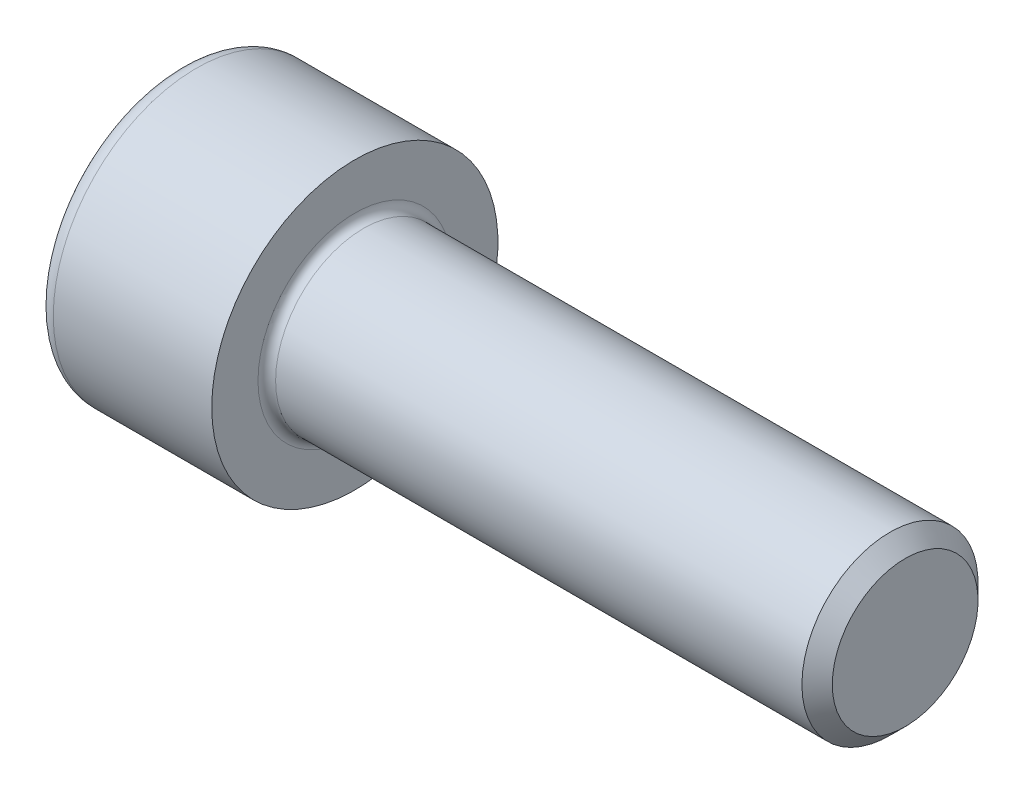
from build123d import *

# Parameters (mm, degrees)
FILLET1_R   = 0.4
FILLET2_R   = 0.8
HEX_2_DEPTH = 4


with BuildPart() as part:
    # BodySke → Base-Revolve (revolve)
    with BuildSketch(Plane.XY, mode=Mode.PRIVATE) as base_revolve_sk:
        Polygon((0, 0), (0, 6.5), (8, 6.5), (8, 4), (32.3095, 4), (33, 3.3095), (33, 0), align=None)
    revolve(base_revolve_sk.sketch.rotate(Axis((-31.75, 0, 0), (1, 0, 0)), 90), axis=Axis((-31.75, 0, 0), (1, 0, 0)))

    # Fillet1
    fillet1_edges = [part.edges().sort_by_distance(p)[0] for p in [
        (8, 0, -4),
    ]]
    fillet(fillet1_edges, radius=FILLET1_R)

    # Fillet2
    fillet2_edges = [part.edges().sort_by_distance(p)[0] for p in [
        (0, 0, -6.5),
    ]]
    fillet(fillet2_edges, radius=FILLET2_R)

    # Sketch2 → Hex-PreBroach (revolve, cut)
    with BuildSketch(Plane.XY, mode=Mode.PRIVATE) as hex_prebroach_sk:
        Polygon((0, 3.01), (4, 3.01), (5.73782431, 0), (0, 0), align=None)
    revolve(hex_prebroach_sk.sketch.rotate(Axis((0, 0, 0), (1, 0, 0)), 90), axis=Axis((0, 0, 0), (1, 0, 0)), mode=Mode.SUBTRACT)

    # Sketch3 → Hex 2 (cut)
    with BuildSketch(Plane(origin=(0, 0, 0), x_dir=(0, 0.500000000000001, 0.866025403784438), z_dir=(-1, 0, 0))):
        Polygon((1.73782431, 3.01), (-1.73782431, 3.01), (-3.475648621, 0), (-1.73782431, -3.01), (1.73782431, -3.01), (3.475648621, 0), align=None)
    extrude(amount=-HEX_2_DEPTH, mode=Mode.SUBTRACT)


solid = part.part
